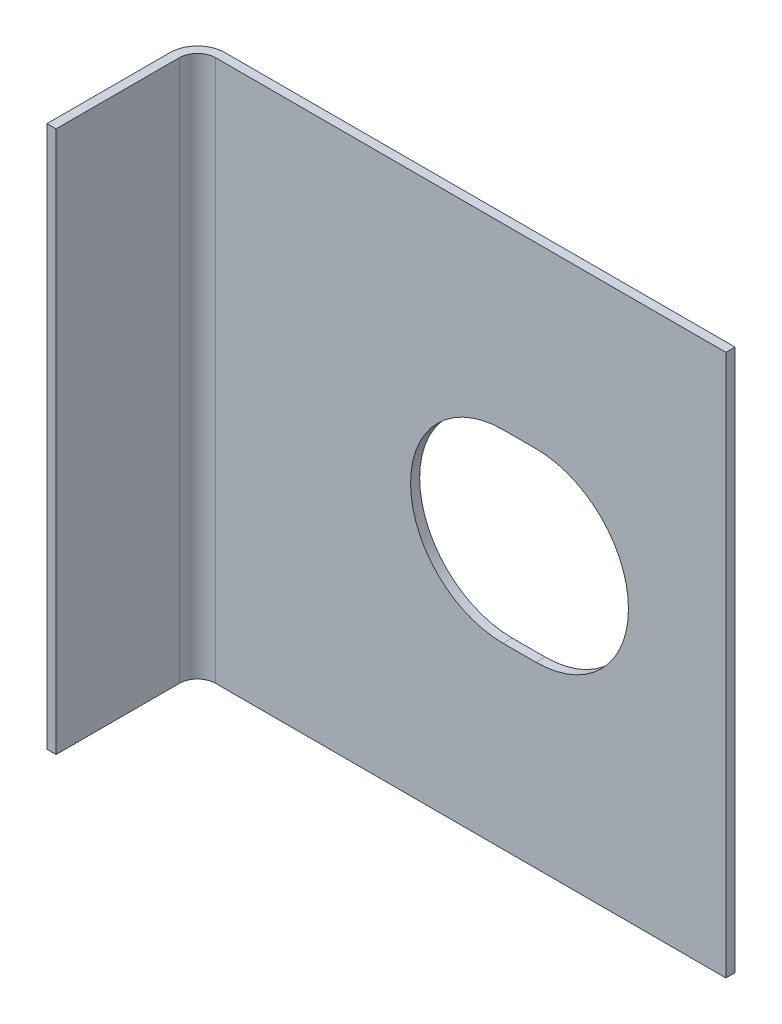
ISO-10303-21;
HEADER;
FILE_DESCRIPTION(('STEP AP214'),'2;1');
FILE_NAME('part.step','',(''),(''),'','','');
FILE_SCHEMA(('AUTOMOTIVE_DESIGN { 1 0 10303 214 1 1 1 1 }'));
ENDSEC;
DATA;
#1=APPLICATION_CONTEXT('core data for automotive mechanical design processes');
#2=APPLICATION_PROTOCOL_DEFINITION('international standard','automotive_design',2000,#1);
#3=PRODUCT_CONTEXT('',#1,'mechanical');
#4=PRODUCT('Part','Part','',(#3));
#5=PRODUCT_RELATED_PRODUCT_CATEGORY('part','',(#4));
#6=PRODUCT_DEFINITION_FORMATION('','',#4);
#7=PRODUCT_DEFINITION_CONTEXT('part definition',#1,'design');
#8=PRODUCT_DEFINITION('design','',#6,#7);
#9=PRODUCT_DEFINITION_SHAPE('','',#8);
#10=(LENGTH_UNIT() NAMED_UNIT(*) SI_UNIT(.MILLI.,.METRE.));
#11=(NAMED_UNIT(*) PLANE_ANGLE_UNIT() SI_UNIT($,.RADIAN.));
#12=(NAMED_UNIT(*) SI_UNIT($,.STERADIAN.) SOLID_ANGLE_UNIT());
#13=UNCERTAINTY_MEASURE_WITH_UNIT(LENGTH_MEASURE(1.E-05),#10,'distance_accuracy_value','');
#14=(GEOMETRIC_REPRESENTATION_CONTEXT(3) GLOBAL_UNCERTAINTY_ASSIGNED_CONTEXT((#13)) GLOBAL_UNIT_ASSIGNED_CONTEXT((#10,
#11,#12)) REPRESENTATION_CONTEXT('',''));
#15=CARTESIAN_POINT('',(0.,0.,0.));
#16=DIRECTION('',(0.,0.,1.));
#17=DIRECTION('',(1.,0.,0.));
#18=AXIS2_PLACEMENT_3D('',#15,#16,#17);
#19=CARTESIAN_POINT('',(-21.195,18.9,1.905));
#20=DIRECTION('',(0.,-1.,0.));
#21=DIRECTION('',(0.,0.,-1.));
#22=AXIS2_PLACEMENT_3D('',#19,#20,#21);
#23=CYLINDRICAL_SURFACE('',#22,1.905);
#24=CARTESIAN_POINT('',(-21.195,-18.9,1.905));
#25=DIRECTION('',(0.,1.,0.));
#26=DIRECTION('',(0.,0.,-1.));
#27=AXIS2_PLACEMENT_3D('',#24,#25,#26);
#28=CIRCLE('',#27,1.905);
#29=CARTESIAN_POINT('',(-21.195,-18.9,0.));
#30=VERTEX_POINT('',#29);
#31=CARTESIAN_POINT('',(-23.1,-18.9,1.905));
#32=VERTEX_POINT('',#31);
#33=EDGE_CURVE('E135',#30,#32,#28,.T.);
#34=ORIENTED_EDGE('',*,*,#33,.T.);
#35=DIRECTION('',(0.,-1.,0.));
#36=VECTOR('',#35,1.);
#37=CARTESIAN_POINT('',(-23.1,18.9,1.905));
#38=LINE('',#37,#36);
#39=CARTESIAN_POINT('',(-23.1,18.9,1.905));
#40=VERTEX_POINT('',#39);
#41=EDGE_CURVE('E9',#40,#32,#38,.T.);
#42=ORIENTED_EDGE('',*,*,#41,.F.);
#43=CARTESIAN_POINT('',(-21.195,18.9,1.905));
#44=DIRECTION('',(0.,1.,0.));
#45=DIRECTION('',(0.,0.,-1.));
#46=AXIS2_PLACEMENT_3D('',#43,#44,#45);
#47=CIRCLE('',#46,1.905);
#48=CARTESIAN_POINT('',(-21.195,18.9,0.));
#49=VERTEX_POINT('',#48);
#50=EDGE_CURVE('E139',#49,#40,#47,.T.);
#51=ORIENTED_EDGE('',*,*,#50,.F.);
#52=DIRECTION('',(0.,-1.,0.));
#53=VECTOR('',#52,1.);
#54=CARTESIAN_POINT('',(-21.195,18.9,0.));
#55=LINE('',#54,#53);
#56=EDGE_CURVE('E157',#49,#30,#55,.T.);
#57=ORIENTED_EDGE('',*,*,#56,.T.);
#58=EDGE_LOOP('',(#34,#42,#51,#57));
#59=FACE_BOUND('',#58,.T.);
#60=ADVANCED_FACE('F14',(#59),#23,.T.);
#61=CARTESIAN_POINT('',(-23.1,18.9,1.905));
#62=DIRECTION('',(1.,0.,0.));
#63=DIRECTION('',(0.,0.,-1.));
#64=AXIS2_PLACEMENT_3D('',#61,#62,#63);
#65=PLANE('',#64);
#66=DIRECTION('',(0.,0.,1.));
#67=VECTOR('',#66,1.);
#68=CARTESIAN_POINT('',(-23.1,-18.9,1.905));
#69=LINE('',#68,#67);
#70=CARTESIAN_POINT('',(-23.1,-18.9,10.5));
#71=VERTEX_POINT('',#70);
#72=EDGE_CURVE('E160',#32,#71,#69,.T.);
#73=ORIENTED_EDGE('',*,*,#72,.T.);
#74=DIRECTION('',(0.,-1.,0.));
#75=VECTOR('',#74,1.);
#76=CARTESIAN_POINT('',(-23.1,18.9,10.5));
#77=LINE('',#76,#75);
#78=CARTESIAN_POINT('',(-23.1,18.9,10.5));
#79=VERTEX_POINT('',#78);
#80=EDGE_CURVE('E21',#79,#71,#77,.T.);
#81=ORIENTED_EDGE('',*,*,#80,.F.);
#82=DIRECTION('',(0.,0.,1.));
#83=VECTOR('',#82,1.);
#84=CARTESIAN_POINT('',(-23.1,18.9,1.905));
#85=LINE('',#84,#83);
#86=EDGE_CURVE('E142',#40,#79,#85,.T.);
#87=ORIENTED_EDGE('',*,*,#86,.F.);
#88=ORIENTED_EDGE('',*,*,#41,.T.);
#89=EDGE_LOOP('',(#73,#81,#87,#88));
#90=FACE_BOUND('',#89,.T.);
#91=ADVANCED_FACE('F217',(#90),#65,.F.);
#92=CARTESIAN_POINT('',(-23.1,18.9,10.5));
#93=DIRECTION('',(0.,0.,-1.));
#94=DIRECTION('',(-1.,0.,0.));
#95=AXIS2_PLACEMENT_3D('',#92,#93,#94);
#96=PLANE('',#95);
#97=DIRECTION('',(1.,0.,0.));
#98=VECTOR('',#97,1.);
#99=CARTESIAN_POINT('',(-23.1,-18.9,10.5));
#100=LINE('',#99,#98);
#101=CARTESIAN_POINT('',(-22.465,-18.9,10.5));
#102=VERTEX_POINT('',#101);
#103=EDGE_CURVE('E162',#71,#102,#100,.T.);
#104=ORIENTED_EDGE('',*,*,#103,.T.);
#105=DIRECTION('',(0.,-1.,0.));
#106=VECTOR('',#105,1.);
#107=CARTESIAN_POINT('',(-22.465,18.9,10.5));
#108=LINE('',#107,#106);
#109=CARTESIAN_POINT('',(-22.465,18.9,10.5));
#110=VERTEX_POINT('',#109);
#111=EDGE_CURVE('E187',#110,#102,#108,.T.);
#112=ORIENTED_EDGE('',*,*,#111,.F.);
#113=DIRECTION('',(1.,0.,0.));
#114=VECTOR('',#113,1.);
#115=CARTESIAN_POINT('',(-23.1,18.9,10.5));
#116=LINE('',#115,#114);
#117=EDGE_CURVE('E145',#79,#110,#116,.T.);
#118=ORIENTED_EDGE('',*,*,#117,.F.);
#119=ORIENTED_EDGE('',*,*,#80,.T.);
#120=EDGE_LOOP('',(#104,#112,#118,#119));
#121=FACE_BOUND('',#120,.T.);
#122=ADVANCED_FACE('F194',(#121),#96,.F.);
#123=CARTESIAN_POINT('',(-22.465,18.9,1.905));
#124=DIRECTION('',(-1.,0.,0.));
#125=DIRECTION('',(0.,0.,1.));
#126=AXIS2_PLACEMENT_3D('',#123,#124,#125);
#127=PLANE('',#126);
#128=DIRECTION('',(0.,0.,-1.));
#129=VECTOR('',#128,1.);
#130=CARTESIAN_POINT('',(-22.465,-18.9,1.905));
#131=LINE('',#130,#129);
#132=CARTESIAN_POINT('',(-22.465,-18.9,1.905));
#133=VERTEX_POINT('',#132);
#134=EDGE_CURVE('E164',#102,#133,#131,.T.);
#135=ORIENTED_EDGE('',*,*,#134,.T.);
#136=DIRECTION('',(0.,-1.,0.));
#137=VECTOR('',#136,1.);
#138=CARTESIAN_POINT('',(-22.465,18.9,1.905));
#139=LINE('',#138,#137);
#140=CARTESIAN_POINT('',(-22.465,18.9,1.905));
#141=VERTEX_POINT('',#140);
#142=EDGE_CURVE('E184',#141,#133,#139,.T.);
#143=ORIENTED_EDGE('',*,*,#142,.F.);
#144=DIRECTION('',(0.,0.,-1.));
#145=VECTOR('',#144,1.);
#146=CARTESIAN_POINT('',(-22.465,18.9,1.905));
#147=LINE('',#146,#145);
#148=EDGE_CURVE('E147',#110,#141,#147,.T.);
#149=ORIENTED_EDGE('',*,*,#148,.F.);
#150=ORIENTED_EDGE('',*,*,#111,.T.);
#151=EDGE_LOOP('',(#135,#143,#149,#150));
#152=FACE_BOUND('',#151,.T.);
#153=ADVANCED_FACE('F205',(#152),#127,.F.);
#154=CARTESIAN_POINT('',(-21.195,18.9,1.905));
#155=DIRECTION('',(0.,-1.,0.));
#156=DIRECTION('',(0.,0.,-1.));
#157=AXIS2_PLACEMENT_3D('',#154,#155,#156);
#158=CYLINDRICAL_SURFACE('',#157,1.27);
#159=CARTESIAN_POINT('',(-21.195,-18.9,1.905));
#160=DIRECTION('',(0.,-1.,0.));
#161=DIRECTION('',(0.,0.,1.));
#162=AXIS2_PLACEMENT_3D('',#159,#160,#161);
#163=CIRCLE('',#162,1.27);
#164=CARTESIAN_POINT('',(-21.195,-18.9,0.635000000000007));
#165=VERTEX_POINT('',#164);
#166=EDGE_CURVE('E166',#133,#165,#163,.T.);
#167=ORIENTED_EDGE('',*,*,#166,.T.);
#168=DIRECTION('',(0.,-1.,0.));
#169=VECTOR('',#168,1.);
#170=CARTESIAN_POINT('',(-21.195,18.9,0.635000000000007));
#171=LINE('',#170,#169);
#172=CARTESIAN_POINT('',(-21.195,18.9,0.635000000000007));
#173=VERTEX_POINT('',#172);
#174=EDGE_CURVE('E181',#173,#165,#171,.T.);
#175=ORIENTED_EDGE('',*,*,#174,.F.);
#176=CARTESIAN_POINT('',(-21.195,18.9,1.905));
#177=DIRECTION('',(0.,-1.,0.));
#178=DIRECTION('',(0.,0.,1.));
#179=AXIS2_PLACEMENT_3D('',#176,#177,#178);
#180=CIRCLE('',#179,1.27);
#181=EDGE_CURVE('E149',#141,#173,#180,.T.);
#182=ORIENTED_EDGE('',*,*,#181,.F.);
#183=ORIENTED_EDGE('',*,*,#142,.T.);
#184=EDGE_LOOP('',(#167,#175,#182,#183));
#185=FACE_BOUND('',#184,.T.);
#186=ADVANCED_FACE('F209',(#185),#158,.F.);
#187=CARTESIAN_POINT('',(14.4,18.9,0.635));
#188=DIRECTION('',(0.,0.,-1.));
#189=DIRECTION('',(-1.,0.,0.));
#190=AXIS2_PLACEMENT_3D('',#187,#188,#189);
#191=PLANE('',#190);
#192=DIRECTION('',(-1.,0.,0.));
#193=VECTOR('',#192,1.);
#194=CARTESIAN_POINT('',(-1.15,-6.45,0.635));
#195=LINE('',#194,#193);
#196=CARTESIAN_POINT('',(1.15,-6.45,0.635));
#197=VERTEX_POINT('',#196);
#198=CARTESIAN_POINT('',(-1.15,-6.45,0.635));
#199=VERTEX_POINT('',#198);
#200=EDGE_CURVE('E110',#197,#199,#195,.T.);
#201=ORIENTED_EDGE('',*,*,#200,.T.);
#202=CARTESIAN_POINT('',(-1.15,0.,0.635));
#203=DIRECTION('',(0.,0.,-1.));
#204=DIRECTION('',(-1.,0.,0.));
#205=AXIS2_PLACEMENT_3D('',#202,#203,#204);
#206=CIRCLE('',#205,6.45);
#207=CARTESIAN_POINT('',(-1.15,6.45,0.635));
#208=VERTEX_POINT('',#207);
#209=EDGE_CURVE('E104',#199,#208,#206,.T.);
#210=ORIENTED_EDGE('',*,*,#209,.T.);
#211=DIRECTION('',(1.,0.,0.));
#212=VECTOR('',#211,1.);
#213=CARTESIAN_POINT('',(-1.15,6.45,0.635));
#214=LINE('',#213,#212);
#215=CARTESIAN_POINT('',(1.15,6.45,0.635));
#216=VERTEX_POINT('',#215);
#217=EDGE_CURVE('E113',#208,#216,#214,.T.);
#218=ORIENTED_EDGE('',*,*,#217,.T.);
#219=CARTESIAN_POINT('',(1.15,0.,0.635));
#220=DIRECTION('',(0.,0.,-1.));
#221=DIRECTION('',(-1.,0.,0.));
#222=AXIS2_PLACEMENT_3D('',#219,#220,#221);
#223=CIRCLE('',#222,6.45);
#224=EDGE_CURVE('E28',#216,#197,#223,.T.);
#225=ORIENTED_EDGE('',*,*,#224,.T.);
#226=EDGE_LOOP('',(#201,#210,#218,#225));
#227=FACE_BOUND('',#226,.T.);
#228=DIRECTION('',(1.,0.,0.));
#229=VECTOR('',#228,1.);
#230=CARTESIAN_POINT('',(14.4,-18.9,0.635));
#231=LINE('',#230,#229);
#232=CARTESIAN_POINT('',(14.4,-18.9,0.635));
#233=VERTEX_POINT('',#232);
#234=EDGE_CURVE('E168',#165,#233,#231,.T.);
#235=ORIENTED_EDGE('',*,*,#234,.T.);
#236=DIRECTION('',(0.,-1.,0.));
#237=VECTOR('',#236,1.);
#238=CARTESIAN_POINT('',(14.4,18.9,0.635));
#239=LINE('',#238,#237);
#240=CARTESIAN_POINT('',(14.4,18.9,0.635));
#241=VERTEX_POINT('',#240);
#242=EDGE_CURVE('E178',#241,#233,#239,.T.);
#243=ORIENTED_EDGE('',*,*,#242,.F.);
#244=DIRECTION('',(1.,0.,0.));
#245=VECTOR('',#244,1.);
#246=CARTESIAN_POINT('',(14.4,18.9,0.635));
#247=LINE('',#246,#245);
#248=EDGE_CURVE('E151',#173,#241,#247,.T.);
#249=ORIENTED_EDGE('',*,*,#248,.F.);
#250=ORIENTED_EDGE('',*,*,#174,.T.);
#251=EDGE_LOOP('',(#235,#243,#249,#250));
#252=FACE_BOUND('',#251,.T.);
#253=ADVANCED_FACE('F117',(#227,#252),#191,.F.);
#254=CARTESIAN_POINT('',(14.4,18.9,0.635));
#255=DIRECTION('',(-1.,0.,0.));
#256=DIRECTION('',(0.,0.,1.));
#257=AXIS2_PLACEMENT_3D('',#254,#255,#256);
#258=PLANE('',#257);
#259=DIRECTION('',(0.,0.,-1.));
#260=VECTOR('',#259,1.);
#261=CARTESIAN_POINT('',(14.4,-18.9,0.635));
#262=LINE('',#261,#260);
#263=CARTESIAN_POINT('',(14.4,-18.9,0.));
#264=VERTEX_POINT('',#263);
#265=EDGE_CURVE('E170',#233,#264,#262,.T.);
#266=ORIENTED_EDGE('',*,*,#265,.T.);
#267=DIRECTION('',(0.,-1.,0.));
#268=VECTOR('',#267,1.);
#269=CARTESIAN_POINT('',(14.4,18.9,0.));
#270=LINE('',#269,#268);
#271=CARTESIAN_POINT('',(14.4,18.9,0.));
#272=VERTEX_POINT('',#271);
#273=EDGE_CURVE('E175',#272,#264,#270,.T.);
#274=ORIENTED_EDGE('',*,*,#273,.F.);
#275=DIRECTION('',(0.,0.,-1.));
#276=VECTOR('',#275,1.);
#277=CARTESIAN_POINT('',(14.4,18.9,0.635));
#278=LINE('',#277,#276);
#279=EDGE_CURVE('E153',#241,#272,#278,.T.);
#280=ORIENTED_EDGE('',*,*,#279,.F.);
#281=ORIENTED_EDGE('',*,*,#242,.T.);
#282=EDGE_LOOP('',(#266,#274,#280,#281));
#283=FACE_BOUND('',#282,.T.);
#284=ADVANCED_FACE('F228',(#283),#258,.F.);
#285=CARTESIAN_POINT('',(14.4,18.9,0.));
#286=DIRECTION('',(0.,0.,1.));
#287=DIRECTION('',(1.,0.,0.));
#288=AXIS2_PLACEMENT_3D('',#285,#286,#287);
#289=PLANE('',#288);
#290=DIRECTION('',(1.,0.,0.));
#291=VECTOR('',#290,1.);
#292=CARTESIAN_POINT('',(-1.15,6.45,0.));
#293=LINE('',#292,#291);
#294=CARTESIAN_POINT('',(-1.15,6.45,0.));
#295=VERTEX_POINT('',#294);
#296=CARTESIAN_POINT('',(1.15,6.45,0.));
#297=VERTEX_POINT('',#296);
#298=EDGE_CURVE('E129',#295,#297,#293,.T.);
#299=ORIENTED_EDGE('',*,*,#298,.F.);
#300=CARTESIAN_POINT('',(-1.15,0.,0.));
#301=DIRECTION('',(0.,0.,-1.));
#302=DIRECTION('',(-1.,0.,0.));
#303=AXIS2_PLACEMENT_3D('',#300,#301,#302);
#304=CIRCLE('',#303,6.45);
#305=CARTESIAN_POINT('',(-1.15,-6.45,0.));
#306=VERTEX_POINT('',#305);
#307=EDGE_CURVE('E36',#306,#295,#304,.T.);
#308=ORIENTED_EDGE('',*,*,#307,.F.);
#309=DIRECTION('',(-1.,0.,0.));
#310=VECTOR('',#309,1.);
#311=CARTESIAN_POINT('',(-1.15,-6.45,0.));
#312=LINE('',#311,#310);
#313=CARTESIAN_POINT('',(1.15,-6.45,0.));
#314=VERTEX_POINT('',#313);
#315=EDGE_CURVE('E120',#314,#306,#312,.T.);
#316=ORIENTED_EDGE('',*,*,#315,.F.);
#317=CARTESIAN_POINT('',(1.15,0.,0.));
#318=DIRECTION('',(0.,0.,-1.));
#319=DIRECTION('',(-1.,0.,0.));
#320=AXIS2_PLACEMENT_3D('',#317,#318,#319);
#321=CIRCLE('',#320,6.45);
#322=EDGE_CURVE('E123',#297,#314,#321,.T.);
#323=ORIENTED_EDGE('',*,*,#322,.F.);
#324=EDGE_LOOP('',(#299,#308,#316,#323));
#325=FACE_BOUND('',#324,.T.);
#326=DIRECTION('',(-1.,0.,0.));
#327=VECTOR('',#326,1.);
#328=CARTESIAN_POINT('',(14.4,-18.9,0.));
#329=LINE('',#328,#327);
#330=EDGE_CURVE('E143',#264,#30,#329,.T.);
#331=ORIENTED_EDGE('',*,*,#330,.T.);
#332=ORIENTED_EDGE('',*,*,#56,.F.);
#333=DIRECTION('',(-1.,0.,0.));
#334=VECTOR('',#333,1.);
#335=CARTESIAN_POINT('',(14.4,18.9,0.));
#336=LINE('',#335,#334);
#337=EDGE_CURVE('E155',#272,#49,#336,.T.);
#338=ORIENTED_EDGE('',*,*,#337,.F.);
#339=ORIENTED_EDGE('',*,*,#273,.T.);
#340=EDGE_LOOP('',(#331,#332,#338,#339));
#341=FACE_BOUND('',#340,.T.);
#342=ADVANCED_FACE('F223',(#325,#341),#289,.F.);
#343=CARTESIAN_POINT('',(-21.195,18.9,1.905));
#344=DIRECTION('',(0.,-1.,0.));
#345=DIRECTION('',(0.,0.,-1.));
#346=AXIS2_PLACEMENT_3D('',#343,#344,#345);
#347=PLANE('',#346);
#348=ORIENTED_EDGE('',*,*,#50,.T.);
#349=ORIENTED_EDGE('',*,*,#86,.T.);
#350=ORIENTED_EDGE('',*,*,#117,.T.);
#351=ORIENTED_EDGE('',*,*,#148,.T.);
#352=ORIENTED_EDGE('',*,*,#181,.T.);
#353=ORIENTED_EDGE('',*,*,#248,.T.);
#354=ORIENTED_EDGE('',*,*,#279,.T.);
#355=ORIENTED_EDGE('',*,*,#337,.T.);
#356=EDGE_LOOP('',(#348,#349,#350,#351,#352,#353,#354,#355));
#357=FACE_BOUND('',#356,.T.);
#358=ADVANCED_FACE('F213',(#357),#347,.F.);
#359=CARTESIAN_POINT('',(-21.195,-18.9,1.905));
#360=DIRECTION('',(0.,-1.,0.));
#361=DIRECTION('',(0.,0.,-1.));
#362=AXIS2_PLACEMENT_3D('',#359,#360,#361);
#363=PLANE('',#362);
#364=ORIENTED_EDGE('',*,*,#33,.F.);
#365=ORIENTED_EDGE('',*,*,#330,.F.);
#366=ORIENTED_EDGE('',*,*,#265,.F.);
#367=ORIENTED_EDGE('',*,*,#234,.F.);
#368=ORIENTED_EDGE('',*,*,#166,.F.);
#369=ORIENTED_EDGE('',*,*,#134,.F.);
#370=ORIENTED_EDGE('',*,*,#103,.F.);
#371=ORIENTED_EDGE('',*,*,#72,.F.);
#372=EDGE_LOOP('',(#364,#365,#366,#367,#368,#369,#370,#371));
#373=FACE_BOUND('',#372,.T.);
#374=ADVANCED_FACE('F200',(#373),#363,.T.);
#375=CARTESIAN_POINT('',(-1.15,0.,0.635));
#376=DIRECTION('',(0.,0.,-1.));
#377=DIRECTION('',(-1.,0.,0.));
#378=AXIS2_PLACEMENT_3D('',#375,#376,#377);
#379=CYLINDRICAL_SURFACE('',#378,6.45);
#380=ORIENTED_EDGE('',*,*,#307,.T.);
#381=DIRECTION('',(0.,0.,-1.));
#382=VECTOR('',#381,1.);
#383=CARTESIAN_POINT('',(-1.15,6.45,0.635));
#384=LINE('',#383,#382);
#385=EDGE_CURVE('E100',#208,#295,#384,.T.);
#386=ORIENTED_EDGE('',*,*,#385,.F.);
#387=ORIENTED_EDGE('',*,*,#209,.F.);
#388=DIRECTION('',(0.,0.,-1.));
#389=VECTOR('',#388,1.);
#390=CARTESIAN_POINT('',(-1.15,-6.45,0.635));
#391=LINE('',#390,#389);
#392=EDGE_CURVE('E133',#199,#306,#391,.T.);
#393=ORIENTED_EDGE('',*,*,#392,.T.);
#394=EDGE_LOOP('',(#380,#386,#387,#393));
#395=FACE_BOUND('',#394,.T.);
#396=ADVANCED_FACE('F102',(#395),#379,.F.);
#397=CARTESIAN_POINT('',(-1.15,-6.45,0.635));
#398=DIRECTION('',(0.,-1.,0.));
#399=DIRECTION('',(0.,0.,-1.));
#400=AXIS2_PLACEMENT_3D('',#397,#398,#399);
#401=PLANE('',#400);
#402=ORIENTED_EDGE('',*,*,#315,.T.);
#403=ORIENTED_EDGE('',*,*,#392,.F.);
#404=ORIENTED_EDGE('',*,*,#200,.F.);
#405=DIRECTION('',(0.,0.,-1.));
#406=VECTOR('',#405,1.);
#407=CARTESIAN_POINT('',(1.15,-6.45,0.635));
#408=LINE('',#407,#406);
#409=EDGE_CURVE('E136',#197,#314,#408,.T.);
#410=ORIENTED_EDGE('',*,*,#409,.T.);
#411=EDGE_LOOP('',(#402,#403,#404,#410));
#412=FACE_BOUND('',#411,.T.);
#413=ADVANCED_FACE('F318',(#412),#401,.F.);
#414=CARTESIAN_POINT('',(1.15,0.,0.635));
#415=DIRECTION('',(0.,0.,-1.));
#416=DIRECTION('',(-1.,0.,0.));
#417=AXIS2_PLACEMENT_3D('',#414,#415,#416);
#418=CYLINDRICAL_SURFACE('',#417,6.45);
#419=ORIENTED_EDGE('',*,*,#322,.T.);
#420=ORIENTED_EDGE('',*,*,#409,.F.);
#421=ORIENTED_EDGE('',*,*,#224,.F.);
#422=DIRECTION('',(0.,0.,-1.));
#423=VECTOR('',#422,1.);
#424=CARTESIAN_POINT('',(1.15,6.45,0.635));
#425=LINE('',#424,#423);
#426=EDGE_CURVE('E109',#216,#297,#425,.T.);
#427=ORIENTED_EDGE('',*,*,#426,.T.);
#428=EDGE_LOOP('',(#419,#420,#421,#427));
#429=FACE_BOUND('',#428,.T.);
#430=ADVANCED_FACE('F326',(#429),#418,.F.);
#431=CARTESIAN_POINT('',(-1.15,6.45,0.635));
#432=DIRECTION('',(0.,1.,0.));
#433=DIRECTION('',(0.,0.,1.));
#434=AXIS2_PLACEMENT_3D('',#431,#432,#433);
#435=PLANE('',#434);
#436=ORIENTED_EDGE('',*,*,#298,.T.);
#437=ORIENTED_EDGE('',*,*,#426,.F.);
#438=ORIENTED_EDGE('',*,*,#217,.F.);
#439=ORIENTED_EDGE('',*,*,#385,.T.);
#440=EDGE_LOOP('',(#436,#437,#438,#439));
#441=FACE_BOUND('',#440,.T.);
#442=ADVANCED_FACE('F114',(#441),#435,.F.);
#443=CLOSED_SHELL('',(#60,#91,#122,#153,#186,#253,#284,#342,#358,#374,#396,#413,#430,#442));
#444=MANIFOLD_SOLID_BREP('B1',#443);
#445=ADVANCED_BREP_SHAPE_REPRESENTATION('',(#18,#444),#14);
#446=SHAPE_DEFINITION_REPRESENTATION(#9,#445);
ENDSEC;
END-ISO-10303-21;
